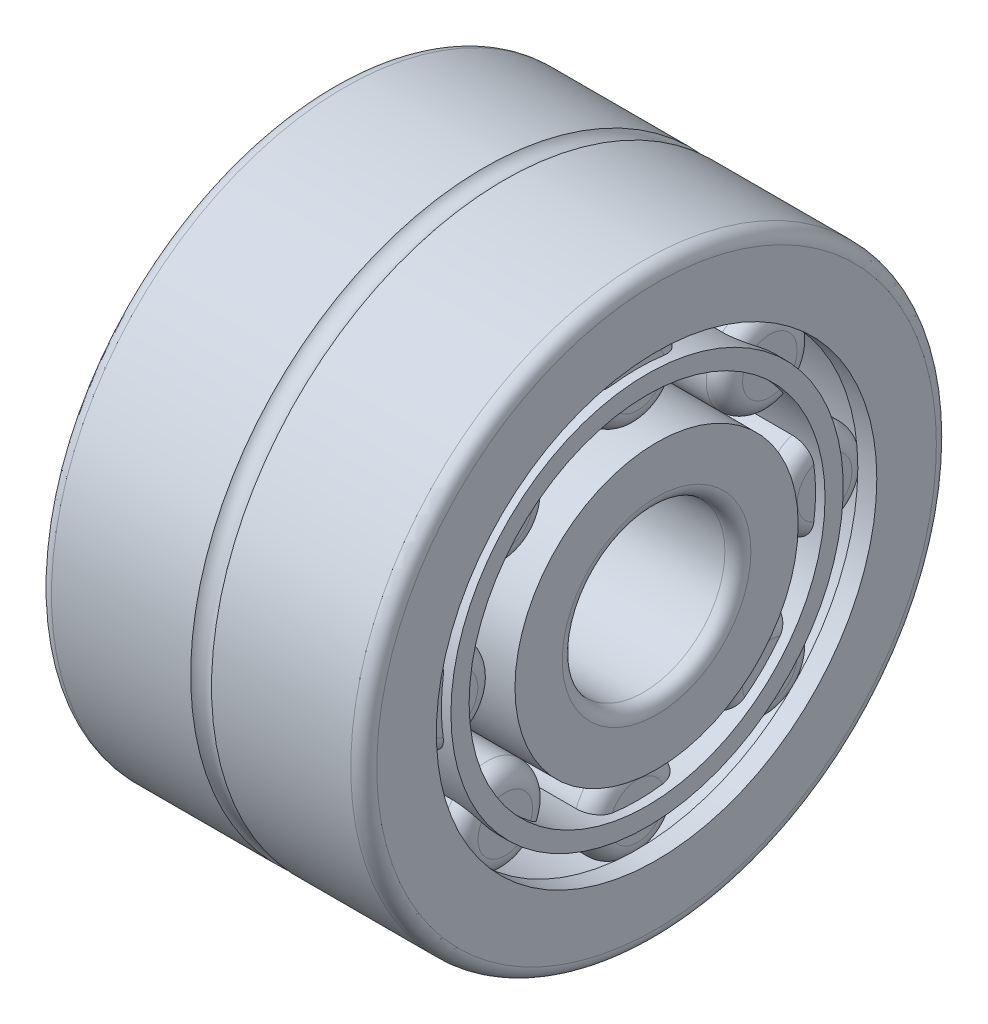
from build123d import *

# Parameters (mm, degrees)
CAGSPISKE_W           = 29.897916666
CAGSPISKE_H           = 1.775025
ROLLERSDETAILED_COUNT = 8
ROLLERSDETAILED_ANGLE = 315


with BuildPart() as part:
    # OutRacSke → OuterRace (revolve)
    with BuildSketch(Plane.XY, mode=Mode.PRIVATE) as outerrace_sk:
        with BuildLine():
            Line((-14.022916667, 22.6933125), (-14.022916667, 21.4933125))
            Line((-14.022916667, 21.4933125), (-15.875, 21.4933125))
            Line((-15.875, 21.4933125), (-15.875, 27.305))
            ThreePointArc((-15.875, 27.305), (-15.503025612, 28.203025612), (-14.605, 28.575))
            Line((-14.605, 28.575), (-1.016, 28.575))
            ThreePointArc((-1.016, 28.575), (0, 28.067), (1.016, 28.575))
            Line((1.016, 28.575), (14.605, 28.575))
            ThreePointArc((14.605, 28.575), (15.503025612, 28.203025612), (15.875, 27.305))
            Line((15.875, 27.305), (15.875, 21.4933125))
            Line((15.875, 21.4933125), (14.022916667, 21.4933125))
            Line((14.022916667, 21.4933125), (14.022916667, 22.6933125))
            Line((14.022916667, 22.6933125), (-14.022916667, 22.6933125))
        make_face()
    revolve(outerrace_sk.sketch.rotate(Axis((-7.9375, 0, 0), (1, 0, 0)), 270), axis=Axis((-7.9375, 0, 0), (1, 0, 0)))

    # RolDetSke → RollerDetailed (revolve)
    with BuildSketch(Plane.XY, mode=Mode.PRIVATE) as rollerdetailed_sk:
        with BuildLine():
            Line((-14.022916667, 20.9187875), (-14.022916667, 18.25625))
            Line((-14.022916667, 18.25625), (14.022916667, 18.25625))
            Line((14.022916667, 18.25625), (14.022916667, 20.9187875))
            ThreePointArc((14.022916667, 20.9187875), (13.503023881, 22.173919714), (12.247891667, 22.6938125))
            Line((12.247891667, 22.6938125), (-12.247891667, 22.6938125))
            ThreePointArc((-12.247891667, 22.6938125), (-13.503023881, 22.173919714), (-14.022916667, 20.9187875))
        make_face()
    rollerdetailed = revolve(rollerdetailed_sk.sketch.rotate(Axis((-28.575, 18.25625, 0), (1, 0, 0)), 270), axis=Axis((-28.575, 18.25625, 0), (1, 0, 0)))

    # InsRacSke → InnerRace (revolve)
    with BuildSketch(Plane.XY, mode=Mode.PRIVATE) as innerrace_sk:
        with BuildLine():
            Line((-15.875, 13.8191875), (-15.875, 9.2075))
            ThreePointArc((-15.875, 9.2075), (-15.503025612, 8.309474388), (-14.605, 7.9375))
            Line((-14.605, 7.9375), (14.605, 7.9375))
            ThreePointArc((14.605, 7.9375), (15.503025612, 8.309474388), (15.875, 9.2075))
            Line((15.875, 9.2075), (15.875, 13.8191875))
            Line((15.875, 13.8191875), (-15.875, 13.8191875))
        make_face()
    revolve(innerrace_sk.sketch.rotate(Axis((-7.9375, 0, 0), (1, 0, 0)), 270), axis=Axis((-7.9375, 0, 0), (1, 0, 0)))

    # CagSpiSke → CageSpine (revolve)
    with BuildSketch(Plane.XY, mode=Mode.PRIVATE) as cagespine_sk:
        with Locations((0, 18.25625)):
            Rectangle(CAGSPISKE_W, CAGSPISKE_H)
    revolve(cagespine_sk.sketch.rotate(Axis((-17.159454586, 0, 0), (1, 0, 0)), 90), axis=Axis((-17.159454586, 0, 0), (1, 0, 0)))

    # RollersDetailed: RollerDetailed ×8 about axis
    rollersdetailed_axis = Axis((-50, 0, 0), (1, 0, 0))
    for i in range(1, ROLLERSDETAILED_COUNT):
        add(rollerdetailed.rotate(rollersdetailed_axis, i * ROLLERSDETAILED_ANGLE / (ROLLERSDETAILED_COUNT - 1)))


solid = part.part
